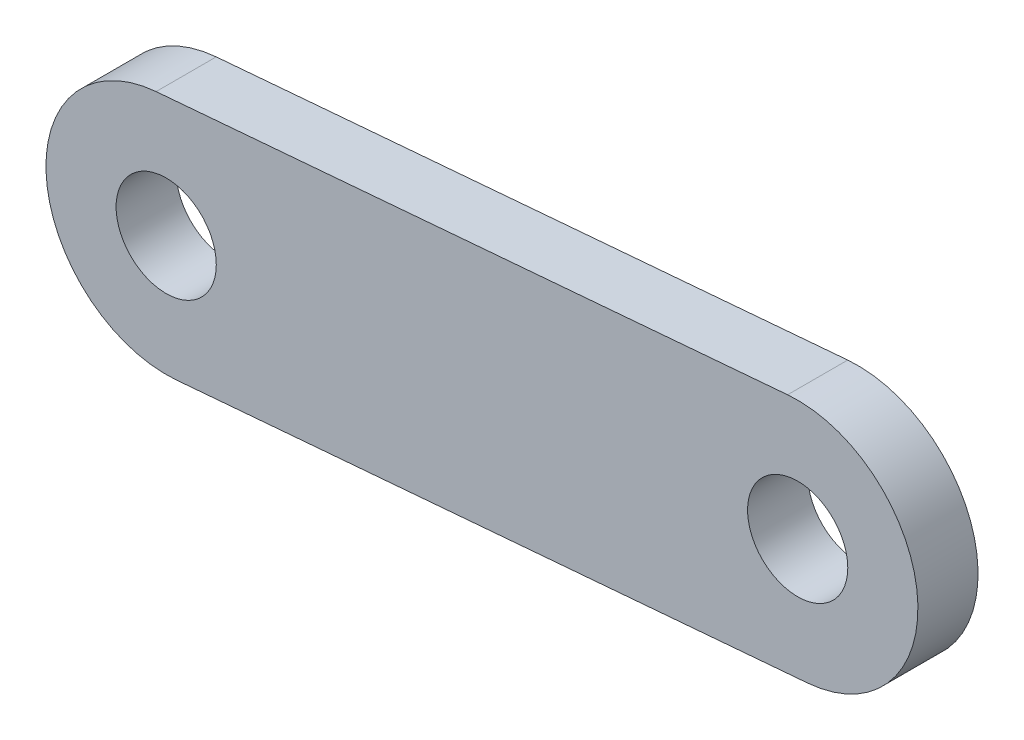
from build123d import *

# Parameters (mm, degrees)
CROQUIS1_R              = 2.5
SALIENTE_EXTRUIR1_DEPTH = 1.5


with BuildPart() as part:
    # Croquis1 → Saliente-Extruir1 (new, symmetric)
    with BuildSketch(Plane.XY):
        with BuildLine():
            Line((15.306420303, 5.978829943), (-16.204780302, 3.324731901))
            ThreePointArc((-16.204780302, 3.324731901), (-21.680030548, -3.157677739), (-15.197620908, -8.632927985))
            Line((-15.197620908, -8.632927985), (16.313579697, -5.978829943))
            ThreePointArc((16.313579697, -5.978829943), (21.788829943, 0.503579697), (15.306420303, 5.978829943))
        make_face()
        with Locations((15.81, 0)):
            Circle(CROQUIS1_R, mode=Mode.SUBTRACT)
        with Locations((-15.701200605, -2.654098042)):
            Circle(CROQUIS1_R, mode=Mode.SUBTRACT)
    extrude(amount=SALIENTE_EXTRUIR1_DEPTH, both=True)


solid = part.part
